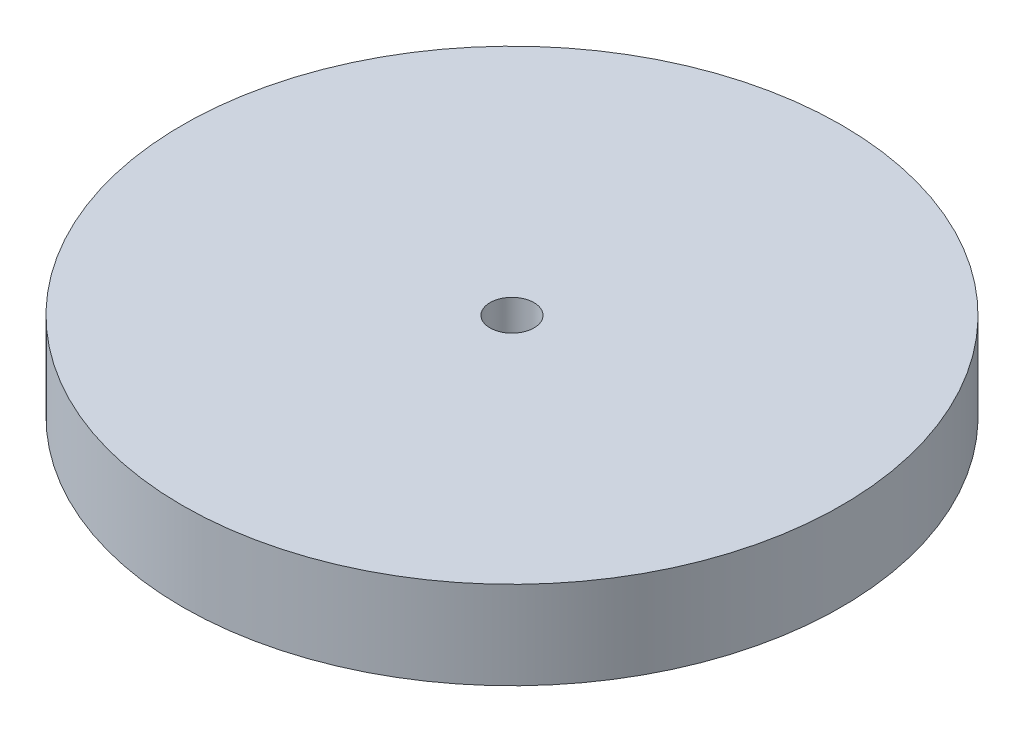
from build123d import *

# Parameters (mm, degrees)
ESQUISSE1_W = 70
ESQUISSE1_H = 20


with BuildPart() as part:
    # Esquisse1 → R_volution1 (revolve)
    with BuildSketch(Plane.XY, mode=Mode.PRIVATE) as r_volution1_sk:
        with Locations((-40, 10)):
            Rectangle(ESQUISSE1_W, ESQUISSE1_H)
    revolve(r_volution1_sk.sketch.rotate(Axis((0, 0, 0), (0, 1, 0)), 270), axis=Axis((0, 0, 0), (0, 1, 0)))


solid = part.part
